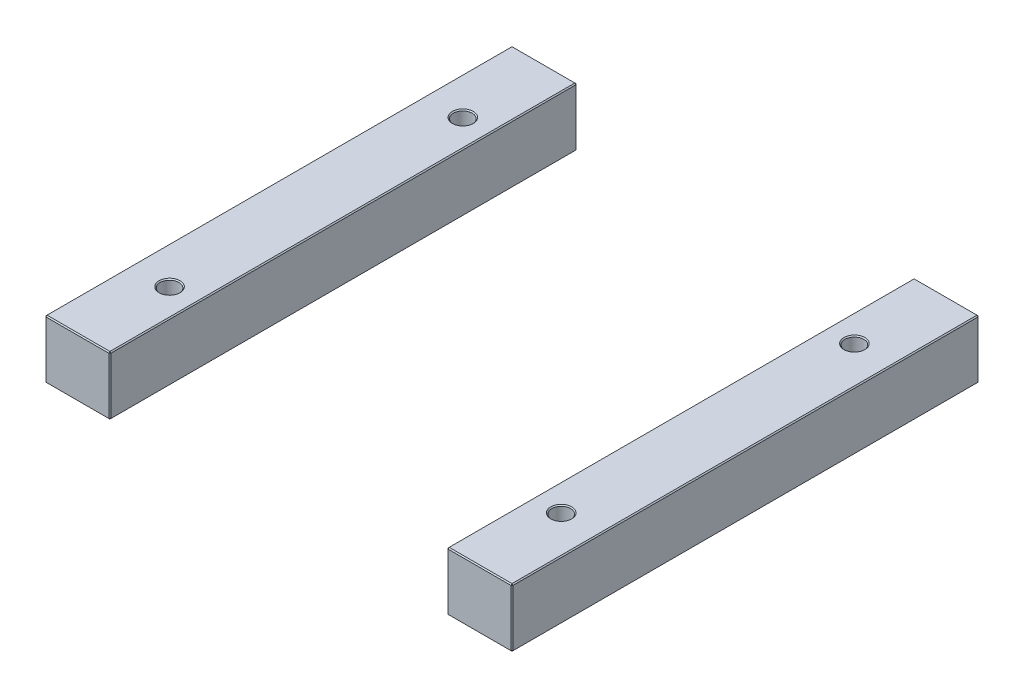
ISO-10303-21;
HEADER;
FILE_DESCRIPTION(('STEP AP214'),'2;1');
FILE_NAME('part.step','',(''),(''),'','','');
FILE_SCHEMA(('AUTOMOTIVE_DESIGN { 1 0 10303 214 1 1 1 1 }'));
ENDSEC;
DATA;
#1=APPLICATION_CONTEXT('core data for automotive mechanical design processes');
#2=APPLICATION_PROTOCOL_DEFINITION('international standard','automotive_design',2000,#1);
#3=PRODUCT_CONTEXT('',#1,'mechanical');
#4=PRODUCT('Part','Part','',(#3));
#5=PRODUCT_RELATED_PRODUCT_CATEGORY('part','',(#4));
#6=PRODUCT_DEFINITION_FORMATION('','',#4);
#7=PRODUCT_DEFINITION_CONTEXT('part definition',#1,'design');
#8=PRODUCT_DEFINITION('design','',#6,#7);
#9=PRODUCT_DEFINITION_SHAPE('','',#8);
#10=(LENGTH_UNIT() NAMED_UNIT(*) SI_UNIT(.MILLI.,.METRE.));
#11=(NAMED_UNIT(*) PLANE_ANGLE_UNIT() SI_UNIT($,.RADIAN.));
#12=(NAMED_UNIT(*) SI_UNIT($,.STERADIAN.) SOLID_ANGLE_UNIT());
#13=UNCERTAINTY_MEASURE_WITH_UNIT(LENGTH_MEASURE(1.E-05),#10,'distance_accuracy_value','');
#14=(GEOMETRIC_REPRESENTATION_CONTEXT(3) GLOBAL_UNCERTAINTY_ASSIGNED_CONTEXT((#13)) GLOBAL_UNIT_ASSIGNED_CONTEXT((#10,
#11,#12)) REPRESENTATION_CONTEXT('',''));
#15=CARTESIAN_POINT('',(0.,0.,0.));
#16=DIRECTION('',(0.,0.,1.));
#17=DIRECTION('',(1.,0.,0.));
#18=AXIS2_PLACEMENT_3D('',#15,#16,#17);
#19=CARTESIAN_POINT('',(-223.,56.,-223.));
#20=DIRECTION('',(0.,0.,1.));
#21=DIRECTION('',(1.,0.,0.));
#22=AXIS2_PLACEMENT_3D('',#19,#20,#21);
#23=PLANE('',#22);
#24=DIRECTION('',(-1.,0.,0.));
#25=VECTOR('',#24,1.);
#26=CARTESIAN_POINT('',(-223.,1.,-223.));
#27=LINE('',#26,#25);
#28=CARTESIAN_POINT('',(-162.,1.,-223.));
#29=VERTEX_POINT('',#28);
#30=CARTESIAN_POINT('',(-222.,1.,-223.));
#31=VERTEX_POINT('',#30);
#32=EDGE_CURVE('P0_E137',#29,#31,#27,.T.);
#33=ORIENTED_EDGE('',*,*,#32,.T.);
#34=DIRECTION('',(0.,1.,0.));
#35=VECTOR('',#34,1.);
#36=CARTESIAN_POINT('',(-222.,56.,-223.));
#37=LINE('',#36,#35);
#38=CARTESIAN_POINT('',(-222.,55.,-223.));
#39=VERTEX_POINT('',#38);
#40=EDGE_CURVE('P0_E235',#31,#39,#37,.T.);
#41=ORIENTED_EDGE('',*,*,#40,.T.);
#42=DIRECTION('',(1.,0.,0.));
#43=VECTOR('',#42,1.);
#44=CARTESIAN_POINT('',(-223.,55.,-223.));
#45=LINE('',#44,#43);
#46=CARTESIAN_POINT('',(-162.,55.,-223.));
#47=VERTEX_POINT('',#46);
#48=EDGE_CURVE('P0_E233',#39,#47,#45,.T.);
#49=ORIENTED_EDGE('',*,*,#48,.T.);
#50=DIRECTION('',(0.,-1.,0.));
#51=VECTOR('',#50,1.);
#52=CARTESIAN_POINT('',(-162.,56.,-223.));
#53=LINE('',#52,#51);
#54=EDGE_CURVE('P0_E230',#47,#29,#53,.T.);
#55=ORIENTED_EDGE('',*,*,#54,.T.);
#56=EDGE_LOOP('',(#33,#41,#49,#55));
#57=FACE_BOUND('',#56,.T.);
#58=ADVANCED_FACE('P0_F16',(#57),#23,.F.);
#59=CARTESIAN_POINT('',(-223.,56.,223.));
#60=DIRECTION('',(1.,0.,0.));
#61=DIRECTION('',(0.,0.,-1.));
#62=AXIS2_PLACEMENT_3D('',#59,#60,#61);
#63=PLANE('',#62);
#64=DIRECTION('',(0.,1.,0.));
#65=VECTOR('',#64,1.);
#66=CARTESIAN_POINT('',(-223.,56.,222.));
#67=LINE('',#66,#65);
#68=CARTESIAN_POINT('',(-223.,1.,222.));
#69=VERTEX_POINT('',#68);
#70=CARTESIAN_POINT('',(-223.,55.,222.));
#71=VERTEX_POINT('',#70);
#72=EDGE_CURVE('P0_E217',#69,#71,#67,.T.);
#73=ORIENTED_EDGE('',*,*,#72,.T.);
#74=DIRECTION('',(0.,0.,-1.));
#75=VECTOR('',#74,1.);
#76=CARTESIAN_POINT('',(-223.,55.,223.));
#77=LINE('',#76,#75);
#78=CARTESIAN_POINT('',(-223.,55.,-222.));
#79=VERTEX_POINT('',#78);
#80=EDGE_CURVE('P0_E228',#71,#79,#77,.T.);
#81=ORIENTED_EDGE('',*,*,#80,.T.);
#82=DIRECTION('',(0.,-1.,0.));
#83=VECTOR('',#82,1.);
#84=CARTESIAN_POINT('',(-223.,56.,-222.));
#85=LINE('',#84,#83);
#86=CARTESIAN_POINT('',(-223.,1.,-222.));
#87=VERTEX_POINT('',#86);
#88=EDGE_CURVE('P0_E225',#79,#87,#85,.T.);
#89=ORIENTED_EDGE('',*,*,#88,.T.);
#90=DIRECTION('',(0.,0.,1.));
#91=VECTOR('',#90,1.);
#92=CARTESIAN_POINT('',(-223.,1.,223.));
#93=LINE('',#92,#91);
#94=EDGE_CURVE('P0_E214',#87,#69,#93,.T.);
#95=ORIENTED_EDGE('',*,*,#94,.T.);
#96=EDGE_LOOP('',(#73,#81,#89,#95));
#97=FACE_BOUND('',#96,.T.);
#98=ADVANCED_FACE('P0_F302',(#97),#63,.F.);
#99=CARTESIAN_POINT('',(-223.,56.,223.));
#100=DIRECTION('',(0.,0.,-1.));
#101=DIRECTION('',(-1.,0.,0.));
#102=AXIS2_PLACEMENT_3D('',#99,#100,#101);
#103=PLANE('',#102);
#104=DIRECTION('',(-1.,0.,0.));
#105=VECTOR('',#104,1.);
#106=CARTESIAN_POINT('',(-223.,55.,223.));
#107=LINE('',#106,#105);
#108=CARTESIAN_POINT('',(-162.,55.,223.));
#109=VERTEX_POINT('',#108);
#110=CARTESIAN_POINT('',(-222.,55.,223.));
#111=VERTEX_POINT('',#110);
#112=EDGE_CURVE('P0_E242',#109,#111,#107,.T.);
#113=ORIENTED_EDGE('',*,*,#112,.T.);
#114=DIRECTION('',(0.,-1.,0.));
#115=VECTOR('',#114,1.);
#116=CARTESIAN_POINT('',(-222.,56.,223.));
#117=LINE('',#116,#115);
#118=CARTESIAN_POINT('',(-222.,1.,223.));
#119=VERTEX_POINT('',#118);
#120=EDGE_CURVE('P0_E244',#111,#119,#117,.T.);
#121=ORIENTED_EDGE('',*,*,#120,.T.);
#122=DIRECTION('',(1.,0.,0.));
#123=VECTOR('',#122,1.);
#124=CARTESIAN_POINT('',(-161.,1.,223.));
#125=LINE('',#124,#123);
#126=CARTESIAN_POINT('',(-162.,1.,223.));
#127=VERTEX_POINT('',#126);
#128=EDGE_CURVE('P0_E240',#119,#127,#125,.T.);
#129=ORIENTED_EDGE('',*,*,#128,.T.);
#130=DIRECTION('',(0.,1.,0.));
#131=VECTOR('',#130,1.);
#132=CARTESIAN_POINT('',(-162.,56.,223.));
#133=LINE('',#132,#131);
#134=EDGE_CURVE('P0_E238',#127,#109,#133,.T.);
#135=ORIENTED_EDGE('',*,*,#134,.T.);
#136=EDGE_LOOP('',(#113,#121,#129,#135));
#137=FACE_BOUND('',#136,.T.);
#138=ADVANCED_FACE('P0_F341',(#137),#103,.F.);
#139=CARTESIAN_POINT('',(-161.,56.,-223.));
#140=DIRECTION('',(-1.,0.,0.));
#141=DIRECTION('',(0.,0.,1.));
#142=AXIS2_PLACEMENT_3D('',#139,#140,#141);
#143=PLANE('',#142);
#144=DIRECTION('',(0.,0.,1.));
#145=VECTOR('',#144,1.);
#146=CARTESIAN_POINT('',(-161.,55.,-223.));
#147=LINE('',#146,#145);
#148=CARTESIAN_POINT('',(-161.,55.,-222.));
#149=VERTEX_POINT('',#148);
#150=CARTESIAN_POINT('',(-161.,55.,222.));
#151=VERTEX_POINT('',#150);
#152=EDGE_CURVE('P0_E31',#149,#151,#147,.T.);
#153=ORIENTED_EDGE('',*,*,#152,.T.);
#154=DIRECTION('',(0.,-1.,0.));
#155=VECTOR('',#154,1.);
#156=CARTESIAN_POINT('',(-161.,56.,222.));
#157=LINE('',#156,#155);
#158=CARTESIAN_POINT('',(-161.,1.,222.));
#159=VERTEX_POINT('',#158);
#160=EDGE_CURVE('P0_E190',#151,#159,#157,.T.);
#161=ORIENTED_EDGE('',*,*,#160,.T.);
#162=DIRECTION('',(0.,0.,-1.));
#163=VECTOR('',#162,1.);
#164=CARTESIAN_POINT('',(-161.,1.,-223.));
#165=LINE('',#164,#163);
#166=CARTESIAN_POINT('',(-161.,1.,-222.));
#167=VERTEX_POINT('',#166);
#168=EDGE_CURVE('P0_E256',#159,#167,#165,.T.);
#169=ORIENTED_EDGE('',*,*,#168,.T.);
#170=DIRECTION('',(0.,1.,0.));
#171=VECTOR('',#170,1.);
#172=CARTESIAN_POINT('',(-161.,56.,-222.));
#173=LINE('',#172,#171);
#174=EDGE_CURVE('P0_E36',#167,#149,#173,.T.);
#175=ORIENTED_EDGE('',*,*,#174,.T.);
#176=EDGE_LOOP('',(#153,#161,#169,#175));
#177=FACE_BOUND('',#176,.T.);
#178=ADVANCED_FACE('P0_F535',(#177),#143,.F.);
#179=CARTESIAN_POINT('',(0.,56.,0.));
#180=DIRECTION('',(0.,-1.,0.));
#181=DIRECTION('',(0.,0.,-1.));
#182=AXIS2_PLACEMENT_3D('',#179,#180,#181);
#183=PLANE('',#182);
#184=CARTESIAN_POINT('',(-187.,56.,140.));
#185=DIRECTION('',(0.,-1.,0.));
#186=DIRECTION('',(0.,0.,-1.));
#187=AXIS2_PLACEMENT_3D('',#184,#185,#186);
#188=CIRCLE('',#187,10.);
#189=CARTESIAN_POINT('',(-187.,56.,130.));
#190=VERTEX_POINT('',#189);
#191=EDGE_CURVE('P0_E24',#190,#190,#188,.T.);
#192=ORIENTED_EDGE('',*,*,#191,.T.);
#193=EDGE_LOOP('',(#192));
#194=FACE_BOUND('',#193,.T.);
#195=CARTESIAN_POINT('',(-187.,56.,-140.));
#196=DIRECTION('',(0.,-1.,0.));
#197=DIRECTION('',(0.,0.,-1.));
#198=AXIS2_PLACEMENT_3D('',#195,#196,#197);
#199=CIRCLE('',#198,10.);
#200=CARTESIAN_POINT('',(-187.,56.,-150.));
#201=VERTEX_POINT('',#200);
#202=EDGE_CURVE('P0_E189',#201,#201,#199,.T.);
#203=ORIENTED_EDGE('',*,*,#202,.T.);
#204=EDGE_LOOP('',(#203));
#205=FACE_BOUND('',#204,.T.);
#206=DIRECTION('',(0.,0.,1.));
#207=VECTOR('',#206,1.);
#208=CARTESIAN_POINT('',(-222.,56.,0.));
#209=LINE('',#208,#207);
#210=CARTESIAN_POINT('',(-222.,56.,-222.));
#211=VERTEX_POINT('',#210);
#212=CARTESIAN_POINT('',(-222.,56.,222.));
#213=VERTEX_POINT('',#212);
#214=EDGE_CURVE('P0_E251',#211,#213,#209,.T.);
#215=ORIENTED_EDGE('',*,*,#214,.T.);
#216=DIRECTION('',(1.,0.,0.));
#217=VECTOR('',#216,1.);
#218=CARTESIAN_POINT('',(0.,56.,222.));
#219=LINE('',#218,#217);
#220=CARTESIAN_POINT('',(-162.,56.,222.));
#221=VERTEX_POINT('',#220);
#222=EDGE_CURVE('P0_E253',#213,#221,#219,.T.);
#223=ORIENTED_EDGE('',*,*,#222,.T.);
#224=DIRECTION('',(0.,0.,-1.));
#225=VECTOR('',#224,1.);
#226=CARTESIAN_POINT('',(-162.,56.,0.));
#227=LINE('',#226,#225);
#228=CARTESIAN_POINT('',(-162.,56.,-222.));
#229=VERTEX_POINT('',#228);
#230=EDGE_CURVE('P0_E247',#221,#229,#227,.T.);
#231=ORIENTED_EDGE('',*,*,#230,.T.);
#232=DIRECTION('',(-1.,0.,0.));
#233=VECTOR('',#232,1.);
#234=CARTESIAN_POINT('',(0.,56.,-222.));
#235=LINE('',#234,#233);
#236=EDGE_CURVE('P0_E249',#229,#211,#235,.T.);
#237=ORIENTED_EDGE('',*,*,#236,.T.);
#238=EDGE_LOOP('',(#215,#223,#231,#237));
#239=FACE_BOUND('',#238,.T.);
#240=ADVANCED_FACE('P0_F195',(#194,#205,#239),#183,.F.);
#241=CARTESIAN_POINT('',(0.,0.,0.));
#242=DIRECTION('',(0.,-1.,0.));
#243=DIRECTION('',(0.,0.,-1.));
#244=AXIS2_PLACEMENT_3D('',#241,#242,#243);
#245=PLANE('',#244);
#246=CARTESIAN_POINT('',(-187.,0.,-140.));
#247=DIRECTION('',(0.,-1.,0.));
#248=DIRECTION('',(0.,0.,-1.));
#249=AXIS2_PLACEMENT_3D('',#246,#247,#248);
#250=CIRCLE('',#249,10.);
#251=CARTESIAN_POINT('',(-187.,0.,-150.));
#252=VERTEX_POINT('',#251);
#253=EDGE_CURVE('P0_E220',#252,#252,#250,.F.);
#254=ORIENTED_EDGE('',*,*,#253,.T.);
#255=EDGE_LOOP('',(#254));
#256=FACE_BOUND('',#255,.T.);
#257=CARTESIAN_POINT('',(-187.,0.,140.));
#258=DIRECTION('',(0.,-1.,0.));
#259=DIRECTION('',(0.,0.,-1.));
#260=AXIS2_PLACEMENT_3D('',#257,#258,#259);
#261=CIRCLE('',#260,10.);
#262=CARTESIAN_POINT('',(-187.,0.,130.));
#263=VERTEX_POINT('',#262);
#264=EDGE_CURVE('P0_E608',#263,#263,#261,.F.);
#265=ORIENTED_EDGE('',*,*,#264,.T.);
#266=EDGE_LOOP('',(#265));
#267=FACE_BOUND('',#266,.T.);
#268=DIRECTION('',(-1.,0.,0.));
#269=VECTOR('',#268,1.);
#270=CARTESIAN_POINT('',(-223.,0.,222.));
#271=LINE('',#270,#269);
#272=CARTESIAN_POINT('',(-162.,0.,222.));
#273=VERTEX_POINT('',#272);
#274=CARTESIAN_POINT('',(-222.,0.,222.));
#275=VERTEX_POINT('',#274);
#276=EDGE_CURVE('P0_E114',#273,#275,#271,.T.);
#277=ORIENTED_EDGE('',*,*,#276,.T.);
#278=DIRECTION('',(0.,0.,-1.));
#279=VECTOR('',#278,1.);
#280=CARTESIAN_POINT('',(-222.,0.,-223.));
#281=LINE('',#280,#279);
#282=CARTESIAN_POINT('',(-222.,0.,-222.));
#283=VERTEX_POINT('',#282);
#284=EDGE_CURVE('P0_E110',#275,#283,#281,.T.);
#285=ORIENTED_EDGE('',*,*,#284,.T.);
#286=DIRECTION('',(1.,0.,0.));
#287=VECTOR('',#286,1.);
#288=CARTESIAN_POINT('',(-161.,0.,-222.));
#289=LINE('',#288,#287);
#290=CARTESIAN_POINT('',(-162.,0.,-222.));
#291=VERTEX_POINT('',#290);
#292=EDGE_CURVE('P0_E104',#283,#291,#289,.T.);
#293=ORIENTED_EDGE('',*,*,#292,.T.);
#294=DIRECTION('',(0.,0.,1.));
#295=VECTOR('',#294,1.);
#296=CARTESIAN_POINT('',(-162.,0.,223.));
#297=LINE('',#296,#295);
#298=EDGE_CURVE('P0_E107',#291,#273,#297,.T.);
#299=ORIENTED_EDGE('',*,*,#298,.T.);
#300=EDGE_LOOP('',(#277,#285,#293,#299));
#301=FACE_BOUND('',#300,.T.);
#302=ADVANCED_FACE('P0_F106',(#256,#267,#301),#245,.T.);
#303=CARTESIAN_POINT('',(-187.,0.,-140.));
#304=DIRECTION('',(0.,1.,0.));
#305=DIRECTION('',(0.,0.,1.));
#306=AXIS2_PLACEMENT_3D('',#303,#304,#305);
#307=CYLINDRICAL_SURFACE('',#306,9.);
#308=CARTESIAN_POINT('',(-187.,55.,-140.));
#309=DIRECTION('',(0.,-1.,0.));
#310=DIRECTION('',(0.,0.,-1.));
#311=AXIS2_PLACEMENT_3D('',#308,#309,#310);
#312=CIRCLE('',#311,9.);
#313=CARTESIAN_POINT('',(-187.,55.,-149.));
#314=VERTEX_POINT('',#313);
#315=EDGE_CURVE('P0_E10',#314,#314,#312,.F.);
#316=ORIENTED_EDGE('',*,*,#315,.T.);
#317=EDGE_LOOP('',(#316));
#318=FACE_BOUND('',#317,.T.);
#319=CARTESIAN_POINT('',(-187.,1.00000000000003,-140.));
#320=DIRECTION('',(0.,-1.,0.));
#321=DIRECTION('',(0.,0.,-1.));
#322=AXIS2_PLACEMENT_3D('',#319,#320,#321);
#323=CIRCLE('',#322,9.);
#324=CARTESIAN_POINT('',(-187.,1.00000000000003,-149.));
#325=VERTEX_POINT('',#324);
#326=EDGE_CURVE('P0_E215',#325,#325,#323,.T.);
#327=ORIENTED_EDGE('',*,*,#326,.T.);
#328=EDGE_LOOP('',(#327));
#329=FACE_BOUND('',#328,.T.);
#330=ADVANCED_FACE('P0_F208',(#318,#329),#307,.F.);
#331=CARTESIAN_POINT('',(-187.,0.,140.));
#332=DIRECTION('',(0.,1.,0.));
#333=DIRECTION('',(0.,0.,1.));
#334=AXIS2_PLACEMENT_3D('',#331,#332,#333);
#335=CYLINDRICAL_SURFACE('',#334,9.);
#336=CARTESIAN_POINT('',(-187.,55.,140.));
#337=DIRECTION('',(0.,-1.,0.));
#338=DIRECTION('',(0.,0.,-1.));
#339=AXIS2_PLACEMENT_3D('',#336,#337,#338);
#340=CIRCLE('',#339,9.);
#341=CARTESIAN_POINT('',(-187.,55.,131.));
#342=VERTEX_POINT('',#341);
#343=EDGE_CURVE('P0_E186',#342,#342,#340,.F.);
#344=ORIENTED_EDGE('',*,*,#343,.T.);
#345=EDGE_LOOP('',(#344));
#346=FACE_BOUND('',#345,.T.);
#347=CARTESIAN_POINT('',(-187.,1.00000000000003,140.));
#348=DIRECTION('',(0.,-1.,0.));
#349=DIRECTION('',(0.,0.,-1.));
#350=AXIS2_PLACEMENT_3D('',#347,#348,#349);
#351=CIRCLE('',#350,9.);
#352=CARTESIAN_POINT('',(-187.,1.00000000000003,131.));
#353=VERTEX_POINT('',#352);
#354=EDGE_CURVE('P0_E212',#353,#353,#351,.T.);
#355=ORIENTED_EDGE('',*,*,#354,.T.);
#356=EDGE_LOOP('',(#355));
#357=FACE_BOUND('',#356,.T.);
#358=ADVANCED_FACE('P0_F204',(#346,#357),#335,.F.);
#359=CARTESIAN_POINT('',(-187.,0.,-140.));
#360=DIRECTION('',(0.,-1.,0.));
#361=DIRECTION('',(0.,0.,-1.));
#362=AXIS2_PLACEMENT_3D('',#359,#360,#361);
#363=CONICAL_SURFACE('',#362,10.,0.785398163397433);
#364=ORIENTED_EDGE('',*,*,#326,.F.);
#365=EDGE_LOOP('',(#364));
#366=FACE_BOUND('',#365,.T.);
#367=ORIENTED_EDGE('',*,*,#253,.F.);
#368=EDGE_LOOP('',(#367));
#369=FACE_BOUND('',#368,.T.);
#370=ADVANCED_FACE('P0_F207',(#366,#369),#363,.F.);
#371=CARTESIAN_POINT('',(-187.,0.,140.));
#372=DIRECTION('',(0.,-1.,0.));
#373=DIRECTION('',(0.,0.,-1.));
#374=AXIS2_PLACEMENT_3D('',#371,#372,#373);
#375=CONICAL_SURFACE('',#374,10.,0.785398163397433);
#376=ORIENTED_EDGE('',*,*,#354,.F.);
#377=EDGE_LOOP('',(#376));
#378=FACE_BOUND('',#377,.T.);
#379=ORIENTED_EDGE('',*,*,#264,.F.);
#380=EDGE_LOOP('',(#379));
#381=FACE_BOUND('',#380,.T.);
#382=ADVANCED_FACE('P0_F347',(#378,#381),#375,.F.);
#383=CARTESIAN_POINT('',(-161.,56.,222.));
#384=DIRECTION('',(-0.707106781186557,0.,-0.707106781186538));
#385=DIRECTION('',(0.,-1.,0.));
#386=AXIS2_PLACEMENT_3D('',#383,#384,#385);
#387=PLANE('',#386);
#388=DIRECTION('',(-0.707106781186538,0.,0.707106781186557));
#389=VECTOR('',#388,1.);
#390=CARTESIAN_POINT('',(-161.5,55.,222.5));
#391=LINE('',#390,#389);
#392=EDGE_CURVE('P0_E125',#109,#151,#391,.F.);
#393=ORIENTED_EDGE('',*,*,#392,.F.);
#394=ORIENTED_EDGE('',*,*,#134,.F.);
#395=DIRECTION('',(0.707106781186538,0.,-0.707106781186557));
#396=VECTOR('',#395,1.);
#397=CARTESIAN_POINT('',(-162.,1.,223.));
#398=LINE('',#397,#396);
#399=EDGE_CURVE('P0_E181',#159,#127,#398,.F.);
#400=ORIENTED_EDGE('',*,*,#399,.F.);
#401=ORIENTED_EDGE('',*,*,#160,.F.);
#402=EDGE_LOOP('',(#393,#394,#400,#401));
#403=FACE_BOUND('',#402,.T.);
#404=ADVANCED_FACE('P0_F351',(#403),#387,.F.);
#405=CARTESIAN_POINT('',(-162.,56.,222.));
#406=DIRECTION('',(0.577350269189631,0.577350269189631,0.577350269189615));
#407=DIRECTION('',(-0.707106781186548,0.707106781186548,0.));
#408=AXIS2_PLACEMENT_3D('',#405,#406,#407);
#409=PLANE('',#408);
#410=DIRECTION('',(0.,0.707106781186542,-0.707106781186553));
#411=VECTOR('',#410,1.);
#412=CARTESIAN_POINT('',(-162.,56.,222.));
#413=LINE('',#412,#411);
#414=EDGE_CURVE('P0_E175',#109,#221,#413,.T.);
#415=ORIENTED_EDGE('',*,*,#414,.F.);
#416=ORIENTED_EDGE('',*,*,#392,.T.);
#417=DIRECTION('',(0.707106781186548,-0.707106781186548,0.));
#418=VECTOR('',#417,1.);
#419=CARTESIAN_POINT('',(-162.,56.,222.));
#420=LINE('',#419,#418);
#421=EDGE_CURVE('P0_E178',#221,#151,#420,.T.);
#422=ORIENTED_EDGE('',*,*,#421,.F.);
#423=EDGE_LOOP('',(#415,#416,#422));
#424=FACE_BOUND('',#423,.T.);
#425=ADVANCED_FACE('P0_F487',(#424),#409,.T.);
#426=CARTESIAN_POINT('',(-162.,1.,223.));
#427=DIRECTION('',(0.577350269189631,-0.577350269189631,0.577350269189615));
#428=DIRECTION('',(0.707106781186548,0.707106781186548,0.));
#429=AXIS2_PLACEMENT_3D('',#426,#427,#428);
#430=PLANE('',#429);
#431=DIRECTION('',(0.707106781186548,0.707106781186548,0.));
#432=VECTOR('',#431,1.);
#433=CARTESIAN_POINT('',(-161.5,0.5,222.));
#434=LINE('',#433,#432);
#435=EDGE_CURVE('P0_E123',#159,#273,#434,.F.);
#436=ORIENTED_EDGE('',*,*,#435,.F.);
#437=ORIENTED_EDGE('',*,*,#399,.T.);
#438=DIRECTION('',(0.,-0.707106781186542,-0.707106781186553));
#439=VECTOR('',#438,1.);
#440=CARTESIAN_POINT('',(-162.,1.,223.));
#441=LINE('',#440,#439);
#442=EDGE_CURVE('P0_E172',#273,#127,#441,.F.);
#443=ORIENTED_EDGE('',*,*,#442,.F.);
#444=EDGE_LOOP('',(#436,#437,#443));
#445=FACE_BOUND('',#444,.T.);
#446=ADVANCED_FACE('P0_F478',(#445),#430,.T.);
#447=CARTESIAN_POINT('',(-162.,56.,0.));
#448=DIRECTION('',(-0.707106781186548,-0.707106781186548,0.));
#449=DIRECTION('',(0.,0.,-1.));
#450=AXIS2_PLACEMENT_3D('',#447,#448,#449);
#451=PLANE('',#450);
#452=ORIENTED_EDGE('',*,*,#421,.T.);
#453=ORIENTED_EDGE('',*,*,#152,.F.);
#454=DIRECTION('',(-0.707106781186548,0.707106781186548,0.));
#455=VECTOR('',#454,1.);
#456=CARTESIAN_POINT('',(-161.5,55.5,-222.));
#457=LINE('',#456,#455);
#458=EDGE_CURVE('P0_E165',#229,#149,#457,.F.);
#459=ORIENTED_EDGE('',*,*,#458,.F.);
#460=ORIENTED_EDGE('',*,*,#230,.F.);
#461=EDGE_LOOP('',(#452,#453,#459,#460));
#462=FACE_BOUND('',#461,.T.);
#463=ADVANCED_FACE('P0_F318',(#462),#451,.F.);
#464=CARTESIAN_POINT('',(0.,56.,222.));
#465=DIRECTION('',(0.,-0.707106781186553,-0.707106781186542));
#466=DIRECTION('',(1.,0.,0.));
#467=AXIS2_PLACEMENT_3D('',#464,#465,#466);
#468=PLANE('',#467);
#469=ORIENTED_EDGE('',*,*,#414,.T.);
#470=ORIENTED_EDGE('',*,*,#222,.F.);
#471=DIRECTION('',(0.,-0.707106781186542,0.707106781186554));
#472=VECTOR('',#471,1.);
#473=CARTESIAN_POINT('',(-222.,55.5,222.5));
#474=LINE('',#473,#472);
#475=EDGE_CURVE('P0_E162',#111,#213,#474,.F.);
#476=ORIENTED_EDGE('',*,*,#475,.F.);
#477=ORIENTED_EDGE('',*,*,#112,.F.);
#478=EDGE_LOOP('',(#469,#470,#476,#477));
#479=FACE_BOUND('',#478,.T.);
#480=ADVANCED_FACE('P0_F313',(#479),#468,.F.);
#481=CARTESIAN_POINT('',(-222.,56.,223.));
#482=DIRECTION('',(0.707106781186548,0.,-0.707106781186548));
#483=DIRECTION('',(0.,-1.,0.));
#484=AXIS2_PLACEMENT_3D('',#481,#482,#483);
#485=PLANE('',#484);
#486=DIRECTION('',(0.707106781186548,0.,0.707106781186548));
#487=VECTOR('',#486,1.);
#488=CARTESIAN_POINT('',(-222.,1.,223.));
#489=LINE('',#488,#487);
#490=EDGE_CURVE('P0_E156',#119,#69,#489,.F.);
#491=ORIENTED_EDGE('',*,*,#490,.F.);
#492=ORIENTED_EDGE('',*,*,#120,.F.);
#493=DIRECTION('',(-0.707106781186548,0.,-0.707106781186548));
#494=VECTOR('',#493,1.);
#495=CARTESIAN_POINT('',(-223.,55.,222.));
#496=LINE('',#495,#494);
#497=EDGE_CURVE('P0_E159',#71,#111,#496,.F.);
#498=ORIENTED_EDGE('',*,*,#497,.F.);
#499=ORIENTED_EDGE('',*,*,#72,.F.);
#500=EDGE_LOOP('',(#491,#492,#498,#499));
#501=FACE_BOUND('',#500,.T.);
#502=ADVANCED_FACE('P0_F307',(#501),#485,.F.);
#503=CARTESIAN_POINT('',(-223.,1.,223.));
#504=DIRECTION('',(0.,-0.707106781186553,0.707106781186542));
#505=DIRECTION('',(-1.,0.,0.));
#506=AXIS2_PLACEMENT_3D('',#503,#504,#505);
#507=PLANE('',#506);
#508=ORIENTED_EDGE('',*,*,#442,.T.);
#509=ORIENTED_EDGE('',*,*,#128,.F.);
#510=DIRECTION('',(0.,0.707106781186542,0.707106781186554));
#511=VECTOR('',#510,1.);
#512=CARTESIAN_POINT('',(-222.,1.,223.));
#513=LINE('',#512,#511);
#514=EDGE_CURVE('P0_E134',#275,#119,#513,.T.);
#515=ORIENTED_EDGE('',*,*,#514,.F.);
#516=ORIENTED_EDGE('',*,*,#276,.F.);
#517=EDGE_LOOP('',(#508,#509,#515,#516));
#518=FACE_BOUND('',#517,.T.);
#519=ADVANCED_FACE('P0_F333',(#518),#507,.T.);
#520=CARTESIAN_POINT('',(-161.,1.,-223.));
#521=DIRECTION('',(0.707106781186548,-0.707106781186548,0.));
#522=DIRECTION('',(0.,0.,1.));
#523=AXIS2_PLACEMENT_3D('',#520,#521,#522);
#524=PLANE('',#523);
#525=ORIENTED_EDGE('',*,*,#435,.T.);
#526=ORIENTED_EDGE('',*,*,#298,.F.);
#527=DIRECTION('',(-0.707106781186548,-0.707106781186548,0.));
#528=VECTOR('',#527,1.);
#529=CARTESIAN_POINT('',(-162.,0.,-222.));
#530=LINE('',#529,#528);
#531=EDGE_CURVE('P0_E120',#167,#291,#530,.T.);
#532=ORIENTED_EDGE('',*,*,#531,.F.);
#533=ORIENTED_EDGE('',*,*,#168,.F.);
#534=EDGE_LOOP('',(#525,#526,#532,#533));
#535=FACE_BOUND('',#534,.T.);
#536=ADVANCED_FACE('P0_F119',(#535),#524,.T.);
#537=CARTESIAN_POINT('',(-162.,56.,-223.));
#538=DIRECTION('',(-0.707106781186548,0.,0.707106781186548));
#539=DIRECTION('',(0.,-1.,0.));
#540=AXIS2_PLACEMENT_3D('',#537,#538,#539);
#541=PLANE('',#540);
#542=DIRECTION('',(0.707106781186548,0.,0.707106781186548));
#543=VECTOR('',#542,1.);
#544=CARTESIAN_POINT('',(-162.,55.,-223.));
#545=LINE('',#544,#543);
#546=EDGE_CURVE('P0_E168',#149,#47,#545,.F.);
#547=ORIENTED_EDGE('',*,*,#546,.F.);
#548=ORIENTED_EDGE('',*,*,#174,.F.);
#549=DIRECTION('',(-0.707106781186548,0.,-0.707106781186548));
#550=VECTOR('',#549,1.);
#551=CARTESIAN_POINT('',(-161.5,1.,-222.5));
#552=LINE('',#551,#550);
#553=EDGE_CURVE('P0_E133',#29,#167,#552,.F.);
#554=ORIENTED_EDGE('',*,*,#553,.F.);
#555=ORIENTED_EDGE('',*,*,#54,.F.);
#556=EDGE_LOOP('',(#547,#548,#554,#555));
#557=FACE_BOUND('',#556,.T.);
#558=ADVANCED_FACE('P0_F323',(#557),#541,.F.);
#559=CARTESIAN_POINT('',(-162.,55.,-223.));
#560=DIRECTION('',(0.577350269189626,0.577350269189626,-0.577350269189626));
#561=DIRECTION('',(-0.707106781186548,0.,-0.707106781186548));
#562=AXIS2_PLACEMENT_3D('',#559,#560,#561);
#563=PLANE('',#562);
#564=ORIENTED_EDGE('',*,*,#458,.T.);
#565=ORIENTED_EDGE('',*,*,#546,.T.);
#566=DIRECTION('',(0.,-0.707106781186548,-0.707106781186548));
#567=VECTOR('',#566,1.);
#568=CARTESIAN_POINT('',(-162.,55.,-223.));
#569=LINE('',#568,#567);
#570=EDGE_CURVE('P0_E151',#229,#47,#569,.T.);
#571=ORIENTED_EDGE('',*,*,#570,.F.);
#572=EDGE_LOOP('',(#564,#565,#571));
#573=FACE_BOUND('',#572,.T.);
#574=ADVANCED_FACE('P0_F321',(#573),#563,.T.);
#575=CARTESIAN_POINT('',(-223.,55.,222.));
#576=DIRECTION('',(-0.57735026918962,0.577350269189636,0.57735026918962));
#577=DIRECTION('',(0.,-0.707106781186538,0.707106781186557));
#578=AXIS2_PLACEMENT_3D('',#575,#576,#577);
#579=PLANE('',#578);
#580=ORIENTED_EDGE('',*,*,#497,.T.);
#581=ORIENTED_EDGE('',*,*,#475,.T.);
#582=DIRECTION('',(0.707106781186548,0.707106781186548,0.));
#583=VECTOR('',#582,1.);
#584=CARTESIAN_POINT('',(-223.,55.,222.));
#585=LINE('',#584,#583);
#586=EDGE_CURVE('P0_E142',#71,#213,#585,.T.);
#587=ORIENTED_EDGE('',*,*,#586,.F.);
#588=EDGE_LOOP('',(#580,#581,#587));
#589=FACE_BOUND('',#588,.T.);
#590=ADVANCED_FACE('P0_F310',(#589),#579,.T.);
#591=CARTESIAN_POINT('',(-222.,1.,223.));
#592=DIRECTION('',(-0.57735026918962,-0.577350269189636,0.57735026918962));
#593=DIRECTION('',(0.,-0.707106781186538,-0.707106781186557));
#594=AXIS2_PLACEMENT_3D('',#591,#592,#593);
#595=PLANE('',#594);
#596=ORIENTED_EDGE('',*,*,#514,.T.);
#597=ORIENTED_EDGE('',*,*,#490,.T.);
#598=DIRECTION('',(0.707106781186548,-0.707106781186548,0.));
#599=VECTOR('',#598,1.);
#600=CARTESIAN_POINT('',(-222.5,0.500000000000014,222.));
#601=LINE('',#600,#599);
#602=EDGE_CURVE('P0_E138',#275,#69,#601,.F.);
#603=ORIENTED_EDGE('',*,*,#602,.F.);
#604=EDGE_LOOP('',(#596,#597,#603));
#605=FACE_BOUND('',#604,.T.);
#606=ADVANCED_FACE('P0_F368',(#605),#595,.T.);
#607=CARTESIAN_POINT('',(-162.,0.,-222.));
#608=DIRECTION('',(0.577350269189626,-0.577350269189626,-0.577350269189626));
#609=DIRECTION('',(-0.707106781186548,0.,-0.707106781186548));
#610=AXIS2_PLACEMENT_3D('',#607,#608,#609);
#611=PLANE('',#610);
#612=ORIENTED_EDGE('',*,*,#553,.T.);
#613=ORIENTED_EDGE('',*,*,#531,.T.);
#614=DIRECTION('',(0.,0.707106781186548,-0.707106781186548));
#615=VECTOR('',#614,1.);
#616=CARTESIAN_POINT('',(-162.,0.,-222.));
#617=LINE('',#616,#615);
#618=EDGE_CURVE('P0_E130',#29,#291,#617,.F.);
#619=ORIENTED_EDGE('',*,*,#618,.F.);
#620=EDGE_LOOP('',(#612,#613,#619));
#621=FACE_BOUND('',#620,.T.);
#622=ADVANCED_FACE('P0_F129',(#621),#611,.T.);
#623=CARTESIAN_POINT('',(0.,56.,-222.));
#624=DIRECTION('',(0.,-0.707106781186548,0.707106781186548));
#625=DIRECTION('',(-1.,0.,0.));
#626=AXIS2_PLACEMENT_3D('',#623,#624,#625);
#627=PLANE('',#626);
#628=ORIENTED_EDGE('',*,*,#570,.T.);
#629=ORIENTED_EDGE('',*,*,#48,.F.);
#630=DIRECTION('',(0.,0.707106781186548,0.707106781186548));
#631=VECTOR('',#630,1.);
#632=CARTESIAN_POINT('',(-222.,55.,-223.));
#633=LINE('',#632,#631);
#634=EDGE_CURVE('P0_E139',#211,#39,#633,.F.);
#635=ORIENTED_EDGE('',*,*,#634,.F.);
#636=ORIENTED_EDGE('',*,*,#236,.F.);
#637=EDGE_LOOP('',(#628,#629,#635,#636));
#638=FACE_BOUND('',#637,.T.);
#639=ADVANCED_FACE('P0_F286',(#638),#627,.F.);
#640=CARTESIAN_POINT('',(-222.,56.,0.));
#641=DIRECTION('',(0.707106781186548,-0.707106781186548,0.));
#642=DIRECTION('',(0.,0.,1.));
#643=AXIS2_PLACEMENT_3D('',#640,#641,#642);
#644=PLANE('',#643);
#645=ORIENTED_EDGE('',*,*,#586,.T.);
#646=ORIENTED_EDGE('',*,*,#214,.F.);
#647=DIRECTION('',(-0.707106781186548,-0.707106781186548,0.));
#648=VECTOR('',#647,1.);
#649=CARTESIAN_POINT('',(-222.5,55.5,-222.));
#650=LINE('',#649,#648);
#651=EDGE_CURVE('P0_E145',#79,#211,#650,.F.);
#652=ORIENTED_EDGE('',*,*,#651,.F.);
#653=ORIENTED_EDGE('',*,*,#80,.F.);
#654=EDGE_LOOP('',(#645,#646,#652,#653));
#655=FACE_BOUND('',#654,.T.);
#656=ADVANCED_FACE('P0_F280',(#655),#644,.F.);
#657=CARTESIAN_POINT('',(-223.,1.,223.));
#658=DIRECTION('',(-0.707106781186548,-0.707106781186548,0.));
#659=DIRECTION('',(0.,0.,-1.));
#660=AXIS2_PLACEMENT_3D('',#657,#658,#659);
#661=PLANE('',#660);
#662=ORIENTED_EDGE('',*,*,#602,.T.);
#663=ORIENTED_EDGE('',*,*,#94,.F.);
#664=DIRECTION('',(-0.707106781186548,0.707106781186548,0.));
#665=VECTOR('',#664,1.);
#666=CARTESIAN_POINT('',(-223.,1.,-222.));
#667=LINE('',#666,#665);
#668=EDGE_CURVE('P0_E267',#283,#87,#667,.T.);
#669=ORIENTED_EDGE('',*,*,#668,.F.);
#670=ORIENTED_EDGE('',*,*,#284,.F.);
#671=EDGE_LOOP('',(#662,#663,#669,#670));
#672=FACE_BOUND('',#671,.T.);
#673=ADVANCED_FACE('P0_F298',(#672),#661,.T.);
#674=CARTESIAN_POINT('',(-223.,1.,-223.));
#675=DIRECTION('',(0.,-0.707106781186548,-0.707106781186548));
#676=DIRECTION('',(1.,0.,0.));
#677=AXIS2_PLACEMENT_3D('',#674,#675,#676);
#678=PLANE('',#677);
#679=ORIENTED_EDGE('',*,*,#618,.T.);
#680=ORIENTED_EDGE('',*,*,#292,.F.);
#681=DIRECTION('',(0.,-0.707106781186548,0.707106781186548));
#682=VECTOR('',#681,1.);
#683=CARTESIAN_POINT('',(-222.,0.5,-222.5));
#684=LINE('',#683,#682);
#685=EDGE_CURVE('P0_E265',#31,#283,#684,.T.);
#686=ORIENTED_EDGE('',*,*,#685,.F.);
#687=ORIENTED_EDGE('',*,*,#32,.F.);
#688=EDGE_LOOP('',(#679,#680,#686,#687));
#689=FACE_BOUND('',#688,.T.);
#690=ADVANCED_FACE('P0_F136',(#689),#678,.T.);
#691=CARTESIAN_POINT('',(-222.,55.,-223.));
#692=DIRECTION('',(-0.577350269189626,0.577350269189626,-0.577350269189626));
#693=DIRECTION('',(-0.707106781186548,0.,0.707106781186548));
#694=AXIS2_PLACEMENT_3D('',#691,#692,#693);
#695=PLANE('',#694);
#696=ORIENTED_EDGE('',*,*,#651,.T.);
#697=ORIENTED_EDGE('',*,*,#634,.T.);
#698=DIRECTION('',(0.707106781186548,0.,-0.707106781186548));
#699=VECTOR('',#698,1.);
#700=CARTESIAN_POINT('',(-222.,55.,-223.));
#701=LINE('',#700,#699);
#702=EDGE_CURVE('P0_E263',#79,#39,#701,.T.);
#703=ORIENTED_EDGE('',*,*,#702,.F.);
#704=EDGE_LOOP('',(#696,#697,#703));
#705=FACE_BOUND('',#704,.T.);
#706=ADVANCED_FACE('P0_F273',(#705),#695,.T.);
#707=CARTESIAN_POINT('',(-223.,1.,-222.));
#708=DIRECTION('',(-0.577350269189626,-0.577350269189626,-0.577350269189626));
#709=DIRECTION('',(-0.707106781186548,0.,0.707106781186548));
#710=AXIS2_PLACEMENT_3D('',#707,#708,#709);
#711=PLANE('',#710);
#712=ORIENTED_EDGE('',*,*,#685,.T.);
#713=ORIENTED_EDGE('',*,*,#668,.T.);
#714=DIRECTION('',(-0.707106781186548,0.,0.707106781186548));
#715=VECTOR('',#714,1.);
#716=CARTESIAN_POINT('',(-223.,1.,-222.));
#717=LINE('',#716,#715);
#718=EDGE_CURVE('P0_E261',#31,#87,#717,.T.);
#719=ORIENTED_EDGE('',*,*,#718,.F.);
#720=EDGE_LOOP('',(#712,#713,#719));
#721=FACE_BOUND('',#720,.T.);
#722=ADVANCED_FACE('P0_F294',(#721),#711,.T.);
#723=CARTESIAN_POINT('',(-223.,56.,-222.));
#724=DIRECTION('',(0.707106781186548,0.,0.707106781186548));
#725=DIRECTION('',(0.,-1.,0.));
#726=AXIS2_PLACEMENT_3D('',#723,#724,#725);
#727=PLANE('',#726);
#728=ORIENTED_EDGE('',*,*,#702,.T.);
#729=ORIENTED_EDGE('',*,*,#40,.F.);
#730=ORIENTED_EDGE('',*,*,#718,.T.);
#731=ORIENTED_EDGE('',*,*,#88,.F.);
#732=EDGE_LOOP('',(#728,#729,#730,#731));
#733=FACE_BOUND('',#732,.T.);
#734=ADVANCED_FACE('P0_F201',(#733),#727,.F.);
#735=CARTESIAN_POINT('',(-187.,55.,140.));
#736=DIRECTION('',(0.,1.,0.));
#737=DIRECTION('',(0.,0.,1.));
#738=AXIS2_PLACEMENT_3D('',#735,#736,#737);
#739=CONICAL_SURFACE('',#738,9.,0.785398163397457);
#740=ORIENTED_EDGE('',*,*,#191,.F.);
#741=EDGE_LOOP('',(#740));
#742=FACE_BOUND('',#741,.T.);
#743=ORIENTED_EDGE('',*,*,#343,.F.);
#744=EDGE_LOOP('',(#743));
#745=FACE_BOUND('',#744,.T.);
#746=ADVANCED_FACE('P0_F198',(#742,#745),#739,.F.);
#747=CARTESIAN_POINT('',(-187.,55.,-140.));
#748=DIRECTION('',(0.,1.,0.));
#749=DIRECTION('',(0.,0.,1.));
#750=AXIS2_PLACEMENT_3D('',#747,#748,#749);
#751=CONICAL_SURFACE('',#750,9.,0.785398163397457);
#752=ORIENTED_EDGE('',*,*,#202,.F.);
#753=EDGE_LOOP('',(#752));
#754=FACE_BOUND('',#753,.T.);
#755=ORIENTED_EDGE('',*,*,#315,.F.);
#756=EDGE_LOOP('',(#755));
#757=FACE_BOUND('',#756,.T.);
#758=ADVANCED_FACE('P0_F18',(#754,#757),#751,.F.);
#759=CLOSED_SHELL('',(#58,#98,#138,#178,#240,#302,#330,#358,#370,#382,#404,#425,#446,#463,#480,
#502,#519,#536,#558,#574,#590,#606,#622,#639,#656,#673,#690,#706,#722,#734,#746,#758));
#760=MANIFOLD_SOLID_BREP('P0_B1',#759);
#761=CARTESIAN_POINT('',(223.,56.,223.));
#762=DIRECTION('',(0.,0.,-1.));
#763=DIRECTION('',(-1.,0.,0.));
#764=AXIS2_PLACEMENT_3D('',#761,#762,#763);
#765=PLANE('',#764);
#766=DIRECTION('',(0.,-1.,0.));
#767=VECTOR('',#766,1.);
#768=CARTESIAN_POINT('',(162.,56.,223.));
#769=LINE('',#768,#767);
#770=CARTESIAN_POINT('',(162.,55.,223.));
#771=VERTEX_POINT('',#770);
#772=CARTESIAN_POINT('',(162.,1.,223.));
#773=VERTEX_POINT('',#772);
#774=EDGE_CURVE('P1_E173',#771,#773,#769,.T.);
#775=ORIENTED_EDGE('',*,*,#774,.T.);
#776=DIRECTION('',(1.,0.,0.));
#777=VECTOR('',#776,1.);
#778=CARTESIAN_POINT('',(223.,1.,223.));
#779=LINE('',#778,#777);
#780=CARTESIAN_POINT('',(222.,1.,223.));
#781=VERTEX_POINT('',#780);
#782=EDGE_CURVE('P1_E175',#773,#781,#779,.T.);
#783=ORIENTED_EDGE('',*,*,#782,.T.);
#784=DIRECTION('',(0.,1.,0.));
#785=VECTOR('',#784,1.);
#786=CARTESIAN_POINT('',(222.,56.,223.));
#787=LINE('',#786,#785);
#788=CARTESIAN_POINT('',(222.,55.,223.));
#789=VERTEX_POINT('',#788);
#790=EDGE_CURVE('P1_E171',#781,#789,#787,.T.);
#791=ORIENTED_EDGE('',*,*,#790,.T.);
#792=DIRECTION('',(-1.,0.,0.));
#793=VECTOR('',#792,1.);
#794=CARTESIAN_POINT('',(161.,55.,223.));
#795=LINE('',#794,#793);
#796=EDGE_CURVE('P1_E169',#789,#771,#795,.T.);
#797=ORIENTED_EDGE('',*,*,#796,.T.);
#798=EDGE_LOOP('',(#775,#783,#791,#797));
#799=FACE_BOUND('',#798,.T.);
#800=ADVANCED_FACE('P1_F16',(#799),#765,.F.);
#801=CARTESIAN_POINT('',(223.,56.,223.));
#802=DIRECTION('',(-1.,0.,0.));
#803=DIRECTION('',(0.,0.,1.));
#804=AXIS2_PLACEMENT_3D('',#801,#802,#803);
#805=PLANE('',#804);
#806=DIRECTION('',(0.,0.,1.));
#807=VECTOR('',#806,1.);
#808=CARTESIAN_POINT('',(223.,55.,223.));
#809=LINE('',#808,#807);
#810=CARTESIAN_POINT('',(223.,55.,-222.));
#811=VERTEX_POINT('',#810);
#812=CARTESIAN_POINT('',(223.,55.,222.));
#813=VERTEX_POINT('',#812);
#814=EDGE_CURVE('P1_E187',#811,#813,#809,.T.);
#815=ORIENTED_EDGE('',*,*,#814,.T.);
#816=DIRECTION('',(0.,-1.,0.));
#817=VECTOR('',#816,1.);
#818=CARTESIAN_POINT('',(223.,56.,222.));
#819=LINE('',#818,#817);
#820=CARTESIAN_POINT('',(223.,1.,222.));
#821=VERTEX_POINT('',#820);
#822=EDGE_CURVE('P1_E193',#813,#821,#819,.T.);
#823=ORIENTED_EDGE('',*,*,#822,.T.);
#824=DIRECTION('',(0.,0.,-1.));
#825=VECTOR('',#824,1.);
#826=CARTESIAN_POINT('',(223.,1.,223.));
#827=LINE('',#826,#825);
#828=CARTESIAN_POINT('',(223.,1.,-222.));
#829=VERTEX_POINT('',#828);
#830=EDGE_CURVE('P1_E191',#821,#829,#827,.T.);
#831=ORIENTED_EDGE('',*,*,#830,.T.);
#832=DIRECTION('',(0.,1.,0.));
#833=VECTOR('',#832,1.);
#834=CARTESIAN_POINT('',(223.,56.,-222.));
#835=LINE('',#834,#833);
#836=EDGE_CURVE('P1_E189',#829,#811,#835,.T.);
#837=ORIENTED_EDGE('',*,*,#836,.T.);
#838=EDGE_LOOP('',(#815,#823,#831,#837));
#839=FACE_BOUND('',#838,.T.);
#840=ADVANCED_FACE('P1_F275',(#839),#805,.F.);
#841=CARTESIAN_POINT('',(223.,56.,-223.));
#842=DIRECTION('',(0.,0.,1.));
#843=DIRECTION('',(1.,0.,0.));
#844=AXIS2_PLACEMENT_3D('',#841,#842,#843);
#845=PLANE('',#844);
#846=DIRECTION('',(0.,-1.,0.));
#847=VECTOR('',#846,1.);
#848=CARTESIAN_POINT('',(222.,56.,-223.));
#849=LINE('',#848,#847);
#850=CARTESIAN_POINT('',(222.,55.,-223.));
#851=VERTEX_POINT('',#850);
#852=CARTESIAN_POINT('',(222.,1.,-223.));
#853=VERTEX_POINT('',#852);
#854=EDGE_CURVE('P1_E164',#851,#853,#849,.T.);
#855=ORIENTED_EDGE('',*,*,#854,.T.);
#856=DIRECTION('',(-1.,0.,0.));
#857=VECTOR('',#856,1.);
#858=CARTESIAN_POINT('',(223.,1.,-223.));
#859=LINE('',#858,#857);
#860=CARTESIAN_POINT('',(162.,1.,-223.));
#861=VERTEX_POINT('',#860);
#862=EDGE_CURVE('P1_E112',#853,#861,#859,.T.);
#863=ORIENTED_EDGE('',*,*,#862,.T.);
#864=DIRECTION('',(0.,1.,0.));
#865=VECTOR('',#864,1.);
#866=CARTESIAN_POINT('',(162.,56.,-223.));
#867=LINE('',#866,#865);
#868=CARTESIAN_POINT('',(162.,55.,-223.));
#869=VERTEX_POINT('',#868);
#870=EDGE_CURVE('P1_E166',#861,#869,#867,.T.);
#871=ORIENTED_EDGE('',*,*,#870,.T.);
#872=DIRECTION('',(1.,0.,0.));
#873=VECTOR('',#872,1.);
#874=CARTESIAN_POINT('',(223.,55.,-223.));
#875=LINE('',#874,#873);
#876=EDGE_CURVE('P1_E162',#869,#851,#875,.T.);
#877=ORIENTED_EDGE('',*,*,#876,.T.);
#878=EDGE_LOOP('',(#855,#863,#871,#877));
#879=FACE_BOUND('',#878,.T.);
#880=ADVANCED_FACE('P1_F332',(#879),#845,.F.);
#881=CARTESIAN_POINT('',(161.,56.,-223.));
#882=DIRECTION('',(1.,0.,0.));
#883=DIRECTION('',(0.,0.,-1.));
#884=AXIS2_PLACEMENT_3D('',#881,#882,#883);
#885=PLANE('',#884);
#886=DIRECTION('',(0.,0.,-1.));
#887=VECTOR('',#886,1.);
#888=CARTESIAN_POINT('',(161.,55.,-223.));
#889=LINE('',#888,#887);
#890=CARTESIAN_POINT('',(161.,55.,222.));
#891=VERTEX_POINT('',#890);
#892=CARTESIAN_POINT('',(161.,55.,-222.));
#893=VERTEX_POINT('',#892);
#894=EDGE_CURVE('P1_E178',#891,#893,#889,.T.);
#895=ORIENTED_EDGE('',*,*,#894,.T.);
#896=DIRECTION('',(0.,-1.,0.));
#897=VECTOR('',#896,1.);
#898=CARTESIAN_POINT('',(161.,56.,-222.));
#899=LINE('',#898,#897);
#900=CARTESIAN_POINT('',(161.,1.,-222.));
#901=VERTEX_POINT('',#900);
#902=EDGE_CURVE('P1_E184',#893,#901,#899,.T.);
#903=ORIENTED_EDGE('',*,*,#902,.T.);
#904=DIRECTION('',(0.,0.,1.));
#905=VECTOR('',#904,1.);
#906=CARTESIAN_POINT('',(161.,1.,-223.));
#907=LINE('',#906,#905);
#908=CARTESIAN_POINT('',(161.,1.,222.));
#909=VERTEX_POINT('',#908);
#910=EDGE_CURVE('P1_E182',#901,#909,#907,.T.);
#911=ORIENTED_EDGE('',*,*,#910,.T.);
#912=DIRECTION('',(0.,1.,0.));
#913=VECTOR('',#912,1.);
#914=CARTESIAN_POINT('',(161.,56.,222.));
#915=LINE('',#914,#913);
#916=EDGE_CURVE('P1_E180',#909,#891,#915,.T.);
#917=ORIENTED_EDGE('',*,*,#916,.T.);
#918=EDGE_LOOP('',(#895,#903,#911,#917));
#919=FACE_BOUND('',#918,.T.);
#920=ADVANCED_FACE('P1_F543',(#919),#885,.F.);
#921=CARTESIAN_POINT('',(0.,56.,0.));
#922=DIRECTION('',(0.,1.,0.));
#923=DIRECTION('',(0.,0.,1.));
#924=AXIS2_PLACEMENT_3D('',#921,#922,#923);
#925=PLANE('',#924);
#926=DIRECTION('',(-1.,0.,0.));
#927=VECTOR('',#926,1.);
#928=CARTESIAN_POINT('',(161.,56.,-222.));
#929=LINE('',#928,#927);
#930=CARTESIAN_POINT('',(222.,56.,-222.));
#931=VERTEX_POINT('',#930);
#932=CARTESIAN_POINT('',(162.,56.,-222.));
#933=VERTEX_POINT('',#932);
#934=EDGE_CURVE('P1_E25',#931,#933,#929,.T.);
#935=ORIENTED_EDGE('',*,*,#934,.T.);
#936=DIRECTION('',(0.,0.,1.));
#937=VECTOR('',#936,1.);
#938=CARTESIAN_POINT('',(162.,56.,223.));
#939=LINE('',#938,#937);
#940=CARTESIAN_POINT('',(162.,56.,222.));
#941=VERTEX_POINT('',#940);
#942=EDGE_CURVE('P1_E10',#933,#941,#939,.T.);
#943=ORIENTED_EDGE('',*,*,#942,.T.);
#944=DIRECTION('',(1.,0.,0.));
#945=VECTOR('',#944,1.);
#946=CARTESIAN_POINT('',(223.,56.,222.));
#947=LINE('',#946,#945);
#948=CARTESIAN_POINT('',(222.,56.,222.));
#949=VERTEX_POINT('',#948);
#950=EDGE_CURVE('P1_E202',#941,#949,#947,.T.);
#951=ORIENTED_EDGE('',*,*,#950,.T.);
#952=DIRECTION('',(0.,0.,-1.));
#953=VECTOR('',#952,1.);
#954=CARTESIAN_POINT('',(222.,56.,-223.));
#955=LINE('',#954,#953);
#956=EDGE_CURVE('P1_E36',#949,#931,#955,.T.);
#957=ORIENTED_EDGE('',*,*,#956,.T.);
#958=EDGE_LOOP('',(#935,#943,#951,#957));
#959=FACE_BOUND('',#958,.T.);
#960=CARTESIAN_POINT('',(187.,56.,-140.));
#961=DIRECTION('',(0.,1.,0.));
#962=DIRECTION('',(0.,0.,1.));
#963=AXIS2_PLACEMENT_3D('',#960,#961,#962);
#964=CIRCLE('',#963,10.);
#965=CARTESIAN_POINT('',(187.,56.,-130.));
#966=VERTEX_POINT('',#965);
#967=EDGE_CURVE('P1_E199',#966,#966,#964,.F.);
#968=ORIENTED_EDGE('',*,*,#967,.T.);
#969=EDGE_LOOP('',(#968));
#970=FACE_BOUND('',#969,.T.);
#971=CARTESIAN_POINT('',(187.,56.,140.));
#972=DIRECTION('',(0.,1.,0.));
#973=DIRECTION('',(0.,0.,1.));
#974=AXIS2_PLACEMENT_3D('',#971,#972,#973);
#975=CIRCLE('',#974,10.);
#976=CARTESIAN_POINT('',(187.,56.,150.));
#977=VERTEX_POINT('',#976);
#978=EDGE_CURVE('P1_E196',#977,#977,#975,.F.);
#979=ORIENTED_EDGE('',*,*,#978,.T.);
#980=EDGE_LOOP('',(#979));
#981=FACE_BOUND('',#980,.T.);
#982=ADVANCED_FACE('P1_F298',(#959,#970,#981),#925,.T.);
#983=CARTESIAN_POINT('',(0.,0.,0.));
#984=DIRECTION('',(0.,1.,0.));
#985=DIRECTION('',(0.,0.,1.));
#986=AXIS2_PLACEMENT_3D('',#983,#984,#985);
#987=PLANE('',#986);
#988=CARTESIAN_POINT('',(187.,0.,-140.));
#989=DIRECTION('',(0.,1.,0.));
#990=DIRECTION('',(0.,0.,1.));
#991=AXIS2_PLACEMENT_3D('',#988,#989,#990);
#992=CIRCLE('',#991,10.);
#993=CARTESIAN_POINT('',(187.,0.,-130.));
#994=VERTEX_POINT('',#993);
#995=EDGE_CURVE('P1_E147',#994,#994,#992,.T.);
#996=ORIENTED_EDGE('',*,*,#995,.T.);
#997=EDGE_LOOP('',(#996));
#998=FACE_BOUND('',#997,.T.);
#999=CARTESIAN_POINT('',(187.,0.,140.));
#1000=DIRECTION('',(0.,1.,0.));
#1001=DIRECTION('',(0.,0.,1.));
#1002=AXIS2_PLACEMENT_3D('',#999,#1000,#1001);
#1003=CIRCLE('',#1002,10.);
#1004=CARTESIAN_POINT('',(187.,0.,150.));
#1005=VERTEX_POINT('',#1004);
#1006=EDGE_CURVE('P1_E141',#1005,#1005,#1003,.T.);
#1007=ORIENTED_EDGE('',*,*,#1006,.T.);
#1008=EDGE_LOOP('',(#1007));
#1009=FACE_BOUND('',#1008,.T.);
#1010=DIRECTION('',(-1.,0.,0.));
#1011=VECTOR('',#1010,1.);
#1012=CARTESIAN_POINT('',(1.98765735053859E-13,0.,222.));
#1013=LINE('',#1012,#1011);
#1014=CARTESIAN_POINT('',(222.,0.,222.));
#1015=VERTEX_POINT('',#1014);
#1016=CARTESIAN_POINT('',(162.,0.,222.));
#1017=VERTEX_POINT('',#1016);
#1018=EDGE_CURVE('P1_E134',#1015,#1017,#1013,.T.);
#1019=ORIENTED_EDGE('',*,*,#1018,.T.);
#1020=DIRECTION('',(0.,0.,-1.));
#1021=VECTOR('',#1020,1.);
#1022=CARTESIAN_POINT('',(162.,0.,0.));
#1023=LINE('',#1022,#1021);
#1024=CARTESIAN_POINT('',(162.,0.,-222.));
#1025=VERTEX_POINT('',#1024);
#1026=EDGE_CURVE('P1_E138',#1017,#1025,#1023,.T.);
#1027=ORIENTED_EDGE('',*,*,#1026,.T.);
#1028=DIRECTION('',(1.,0.,0.));
#1029=VECTOR('',#1028,1.);
#1030=CARTESIAN_POINT('',(-5.96297205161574E-13,0.,-222.));
#1031=LINE('',#1030,#1029);
#1032=CARTESIAN_POINT('',(222.,0.,-222.));
#1033=VERTEX_POINT('',#1032);
#1034=EDGE_CURVE('P1_E109',#1025,#1033,#1031,.T.);
#1035=ORIENTED_EDGE('',*,*,#1034,.T.);
#1036=DIRECTION('',(0.,0.,1.));
#1037=VECTOR('',#1036,1.);
#1038=CARTESIAN_POINT('',(222.,0.,0.));
#1039=LINE('',#1038,#1037);
#1040=EDGE_CURVE('P1_E128',#1033,#1015,#1039,.T.);
#1041=ORIENTED_EDGE('',*,*,#1040,.T.);
#1042=EDGE_LOOP('',(#1019,#1027,#1035,#1041));
#1043=FACE_BOUND('',#1042,.T.);
#1044=ADVANCED_FACE('P1_F136',(#998,#1009,#1043),#987,.F.);
#1045=CARTESIAN_POINT('',(187.,0.,-140.));
#1046=DIRECTION('',(0.,1.,0.));
#1047=DIRECTION('',(0.,0.,1.));
#1048=AXIS2_PLACEMENT_3D('',#1045,#1046,#1047);
#1049=CYLINDRICAL_SURFACE('',#1048,9.);
#1050=CARTESIAN_POINT('',(187.,0.999999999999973,-140.));
#1051=DIRECTION('',(0.,1.,0.));
#1052=DIRECTION('',(0.,0.,1.));
#1053=AXIS2_PLACEMENT_3D('',#1050,#1051,#1052);
#1054=CIRCLE('',#1053,9.);
#1055=CARTESIAN_POINT('',(187.,0.999999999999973,-131.));
#1056=VERTEX_POINT('',#1055);
#1057=EDGE_CURVE('P1_E153',#1056,#1056,#1054,.F.);
#1058=ORIENTED_EDGE('',*,*,#1057,.T.);
#1059=EDGE_LOOP('',(#1058));
#1060=FACE_BOUND('',#1059,.T.);
#1061=CARTESIAN_POINT('',(187.,55.,-140.));
#1062=DIRECTION('',(0.,1.,0.));
#1063=DIRECTION('',(0.,0.,1.));
#1064=AXIS2_PLACEMENT_3D('',#1061,#1062,#1063);
#1065=CIRCLE('',#1064,9.);
#1066=CARTESIAN_POINT('',(187.,55.,-131.));
#1067=VERTEX_POINT('',#1066);
#1068=EDGE_CURVE('P1_E150',#1067,#1067,#1065,.T.);
#1069=ORIENTED_EDGE('',*,*,#1068,.T.);
#1070=EDGE_LOOP('',(#1069));
#1071=FACE_BOUND('',#1070,.T.);
#1072=ADVANCED_FACE('P1_F514',(#1060,#1071),#1049,.F.);
#1073=CARTESIAN_POINT('',(187.,0.,140.));
#1074=DIRECTION('',(0.,1.,0.));
#1075=DIRECTION('',(0.,0.,1.));
#1076=AXIS2_PLACEMENT_3D('',#1073,#1074,#1075);
#1077=CYLINDRICAL_SURFACE('',#1076,9.);
#1078=CARTESIAN_POINT('',(187.,0.999999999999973,140.));
#1079=DIRECTION('',(0.,1.,0.));
#1080=DIRECTION('',(0.,0.,1.));
#1081=AXIS2_PLACEMENT_3D('',#1078,#1079,#1080);
#1082=CIRCLE('',#1081,9.);
#1083=CARTESIAN_POINT('',(187.,0.999999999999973,149.));
#1084=VERTEX_POINT('',#1083);
#1085=EDGE_CURVE('P1_E159',#1084,#1084,#1082,.F.);
#1086=ORIENTED_EDGE('',*,*,#1085,.T.);
#1087=EDGE_LOOP('',(#1086));
#1088=FACE_BOUND('',#1087,.T.);
#1089=CARTESIAN_POINT('',(187.,55.,140.));
#1090=DIRECTION('',(0.,1.,0.));
#1091=DIRECTION('',(0.,0.,1.));
#1092=AXIS2_PLACEMENT_3D('',#1089,#1090,#1091);
#1093=CIRCLE('',#1092,9.);
#1094=CARTESIAN_POINT('',(187.,55.,149.));
#1095=VERTEX_POINT('',#1094);
#1096=EDGE_CURVE('P1_E156',#1095,#1095,#1093,.T.);
#1097=ORIENTED_EDGE('',*,*,#1096,.T.);
#1098=EDGE_LOOP('',(#1097));
#1099=FACE_BOUND('',#1098,.T.);
#1100=ADVANCED_FACE('P1_F340',(#1088,#1099),#1077,.F.);
#1101=CARTESIAN_POINT('',(187.,0.,-140.));
#1102=DIRECTION('',(0.,-1.,0.));
#1103=DIRECTION('',(0.,0.,-1.));
#1104=AXIS2_PLACEMENT_3D('',#1101,#1102,#1103);
#1105=CONICAL_SURFACE('',#1104,10.,0.785398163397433);
#1106=ORIENTED_EDGE('',*,*,#1057,.F.);
#1107=EDGE_LOOP('',(#1106));
#1108=FACE_BOUND('',#1107,.T.);
#1109=ORIENTED_EDGE('',*,*,#995,.F.);
#1110=EDGE_LOOP('',(#1109));
#1111=FACE_BOUND('',#1110,.T.);
#1112=ADVANCED_FACE('P1_F336',(#1108,#1111),#1105,.F.);
#1113=CARTESIAN_POINT('',(187.,0.,140.));
#1114=DIRECTION('',(0.,-1.,0.));
#1115=DIRECTION('',(0.,0.,-1.));
#1116=AXIS2_PLACEMENT_3D('',#1113,#1114,#1115);
#1117=CONICAL_SURFACE('',#1116,10.,0.785398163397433);
#1118=ORIENTED_EDGE('',*,*,#1085,.F.);
#1119=EDGE_LOOP('',(#1118));
#1120=FACE_BOUND('',#1119,.T.);
#1121=ORIENTED_EDGE('',*,*,#1006,.F.);
#1122=EDGE_LOOP('',(#1121));
#1123=FACE_BOUND('',#1122,.T.);
#1124=ADVANCED_FACE('P1_F339',(#1120,#1123),#1117,.F.);
#1125=CARTESIAN_POINT('',(1.98765735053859E-13,56.,222.));
#1126=DIRECTION('',(0.,0.707106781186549,0.707106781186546));
#1127=DIRECTION('',(-1.,0.,0.));
#1128=AXIS2_PLACEMENT_3D('',#1125,#1126,#1127);
#1129=PLANE('',#1128);
#1130=DIRECTION('',(0.,-0.707106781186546,0.707106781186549));
#1131=VECTOR('',#1130,1.);
#1132=CARTESIAN_POINT('',(222.,55.,223.));
#1133=LINE('',#1132,#1131);
#1134=EDGE_CURVE('P1_E20',#949,#789,#1133,.T.);
#1135=ORIENTED_EDGE('',*,*,#1134,.F.);
#1136=ORIENTED_EDGE('',*,*,#950,.F.);
#1137=DIRECTION('',(0.,0.707106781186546,-0.70710678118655));
#1138=VECTOR('',#1137,1.);
#1139=CARTESIAN_POINT('',(162.,55.5,222.5));
#1140=LINE('',#1139,#1138);
#1141=EDGE_CURVE('P1_E254',#771,#941,#1140,.T.);
#1142=ORIENTED_EDGE('',*,*,#1141,.F.);
#1143=ORIENTED_EDGE('',*,*,#796,.F.);
#1144=EDGE_LOOP('',(#1135,#1136,#1142,#1143));
#1145=FACE_BOUND('',#1144,.T.);
#1146=ADVANCED_FACE('P1_F300',(#1145),#1129,.T.);
#1147=CARTESIAN_POINT('',(222.,55.,223.));
#1148=DIRECTION('',(0.577350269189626,0.577350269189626,0.577350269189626));
#1149=DIRECTION('',(0.707106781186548,0.,-0.707106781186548));
#1150=AXIS2_PLACEMENT_3D('',#1147,#1148,#1149);
#1151=PLANE('',#1150);
#1152=DIRECTION('',(-0.707106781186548,0.707106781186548,0.));
#1153=VECTOR('',#1152,1.);
#1154=CARTESIAN_POINT('',(222.5,55.5,222.));
#1155=LINE('',#1154,#1153);
#1156=EDGE_CURVE('P1_E249',#949,#813,#1155,.F.);
#1157=ORIENTED_EDGE('',*,*,#1156,.F.);
#1158=ORIENTED_EDGE('',*,*,#1134,.T.);
#1159=DIRECTION('',(-0.707106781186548,0.,0.707106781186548));
#1160=VECTOR('',#1159,1.);
#1161=CARTESIAN_POINT('',(222.,55.,223.));
#1162=LINE('',#1161,#1160);
#1163=EDGE_CURVE('P1_E252',#813,#789,#1162,.T.);
#1164=ORIENTED_EDGE('',*,*,#1163,.F.);
#1165=EDGE_LOOP('',(#1157,#1158,#1164));
#1166=FACE_BOUND('',#1165,.T.);
#1167=ADVANCED_FACE('P1_F266',(#1166),#1151,.T.);
#1168=CARTESIAN_POINT('',(161.,55.,222.));
#1169=DIRECTION('',(-0.577350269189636,0.57735026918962,0.57735026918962));
#1170=DIRECTION('',(0.707106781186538,0.,0.707106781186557));
#1171=AXIS2_PLACEMENT_3D('',#1168,#1169,#1170);
#1172=PLANE('',#1171);
#1173=DIRECTION('',(-0.707106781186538,0.,-0.707106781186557));
#1174=VECTOR('',#1173,1.);
#1175=CARTESIAN_POINT('',(161.,55.,222.));
#1176=LINE('',#1175,#1174);
#1177=EDGE_CURVE('P1_E244',#771,#891,#1176,.T.);
#1178=ORIENTED_EDGE('',*,*,#1177,.F.);
#1179=ORIENTED_EDGE('',*,*,#1141,.T.);
#1180=DIRECTION('',(-0.707106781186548,-0.707106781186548,0.));
#1181=VECTOR('',#1180,1.);
#1182=CARTESIAN_POINT('',(161.,55.,222.));
#1183=LINE('',#1182,#1181);
#1184=EDGE_CURVE('P1_E247',#891,#941,#1183,.F.);
#1185=ORIENTED_EDGE('',*,*,#1184,.F.);
#1186=EDGE_LOOP('',(#1178,#1179,#1185));
#1187=FACE_BOUND('',#1186,.T.);
#1188=ADVANCED_FACE('P1_F302',(#1187),#1172,.T.);
#1189=CARTESIAN_POINT('',(223.,56.,222.));
#1190=DIRECTION('',(-0.707106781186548,0.,-0.707106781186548));
#1191=DIRECTION('',(0.,-1.,0.));
#1192=AXIS2_PLACEMENT_3D('',#1189,#1190,#1191);
#1193=PLANE('',#1192);
#1194=ORIENTED_EDGE('',*,*,#1163,.T.);
#1195=ORIENTED_EDGE('',*,*,#790,.F.);
#1196=DIRECTION('',(0.707106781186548,0.,-0.707106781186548));
#1197=VECTOR('',#1196,1.);
#1198=CARTESIAN_POINT('',(222.,1.,223.));
#1199=LINE('',#1198,#1197);
#1200=EDGE_CURVE('P1_E239',#821,#781,#1199,.F.);
#1201=ORIENTED_EDGE('',*,*,#1200,.F.);
#1202=ORIENTED_EDGE('',*,*,#822,.F.);
#1203=EDGE_LOOP('',(#1194,#1195,#1201,#1202));
#1204=FACE_BOUND('',#1203,.T.);
#1205=ADVANCED_FACE('P1_F272',(#1204),#1193,.F.);
#1206=CARTESIAN_POINT('',(222.,56.,0.));
#1207=DIRECTION('',(0.707106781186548,0.707106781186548,0.));
#1208=DIRECTION('',(0.,0.,1.));
#1209=AXIS2_PLACEMENT_3D('',#1206,#1207,#1208);
#1210=PLANE('',#1209);
#1211=ORIENTED_EDGE('',*,*,#1156,.T.);
#1212=ORIENTED_EDGE('',*,*,#814,.F.);
#1213=DIRECTION('',(0.707106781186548,-0.707106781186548,0.));
#1214=VECTOR('',#1213,1.);
#1215=CARTESIAN_POINT('',(223.,55.,-222.));
#1216=LINE('',#1215,#1214);
#1217=EDGE_CURVE('P1_E236',#931,#811,#1216,.T.);
#1218=ORIENTED_EDGE('',*,*,#1217,.F.);
#1219=ORIENTED_EDGE('',*,*,#956,.F.);
#1220=EDGE_LOOP('',(#1211,#1212,#1218,#1219));
#1221=FACE_BOUND('',#1220,.T.);
#1222=ADVANCED_FACE('P1_F280',(#1221),#1210,.T.);
#1223=CARTESIAN_POINT('',(-5.96297205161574E-13,56.,-222.));
#1224=DIRECTION('',(0.,0.707106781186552,-0.707106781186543));
#1225=DIRECTION('',(1.,0.,0.));
#1226=AXIS2_PLACEMENT_3D('',#1223,#1224,#1225);
#1227=PLANE('',#1226);
#1228=DIRECTION('',(0.,-0.707106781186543,-0.707106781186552));
#1229=VECTOR('',#1228,1.);
#1230=CARTESIAN_POINT('',(162.,55.,-223.));
#1231=LINE('',#1230,#1229);
#1232=EDGE_CURVE('P1_E230',#933,#869,#1231,.T.);
#1233=ORIENTED_EDGE('',*,*,#1232,.F.);
#1234=ORIENTED_EDGE('',*,*,#934,.F.);
#1235=DIRECTION('',(0.,0.707106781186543,0.707106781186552));
#1236=VECTOR('',#1235,1.);
#1237=CARTESIAN_POINT('',(222.,55.5,-222.5));
#1238=LINE('',#1237,#1236);
#1239=EDGE_CURVE('P1_E233',#851,#931,#1238,.T.);
#1240=ORIENTED_EDGE('',*,*,#1239,.F.);
#1241=ORIENTED_EDGE('',*,*,#876,.F.);
#1242=EDGE_LOOP('',(#1233,#1234,#1240,#1241));
#1243=FACE_BOUND('',#1242,.T.);
#1244=ADVANCED_FACE('P1_F289',(#1243),#1227,.T.);
#1245=CARTESIAN_POINT('',(162.,56.,0.));
#1246=DIRECTION('',(-0.707106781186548,0.707106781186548,0.));
#1247=DIRECTION('',(0.,0.,-1.));
#1248=AXIS2_PLACEMENT_3D('',#1245,#1246,#1247);
#1249=PLANE('',#1248);
#1250=ORIENTED_EDGE('',*,*,#1184,.T.);
#1251=ORIENTED_EDGE('',*,*,#942,.F.);
#1252=DIRECTION('',(0.707106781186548,0.707106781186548,0.));
#1253=VECTOR('',#1252,1.);
#1254=CARTESIAN_POINT('',(161.5,55.5,-222.));
#1255=LINE('',#1254,#1253);
#1256=EDGE_CURVE('P1_E227',#893,#933,#1255,.T.);
#1257=ORIENTED_EDGE('',*,*,#1256,.F.);
#1258=ORIENTED_EDGE('',*,*,#894,.F.);
#1259=EDGE_LOOP('',(#1250,#1251,#1257,#1258));
#1260=FACE_BOUND('',#1259,.T.);
#1261=ADVANCED_FACE('P1_F297',(#1260),#1249,.T.);
#1262=CARTESIAN_POINT('',(162.,56.,223.));
#1263=DIRECTION('',(0.707106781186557,0.,-0.707106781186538));
#1264=DIRECTION('',(0.,-1.,0.));
#1265=AXIS2_PLACEMENT_3D('',#1262,#1263,#1264);
#1266=PLANE('',#1265);
#1267=ORIENTED_EDGE('',*,*,#1177,.T.);
#1268=ORIENTED_EDGE('',*,*,#916,.F.);
#1269=DIRECTION('',(0.707106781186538,0.,0.707106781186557));
#1270=VECTOR('',#1269,1.);
#1271=CARTESIAN_POINT('',(161.5,1.,222.5));
#1272=LINE('',#1271,#1270);
#1273=EDGE_CURVE('P1_E224',#773,#909,#1272,.F.);
#1274=ORIENTED_EDGE('',*,*,#1273,.F.);
#1275=ORIENTED_EDGE('',*,*,#774,.F.);
#1276=EDGE_LOOP('',(#1267,#1268,#1274,#1275));
#1277=FACE_BOUND('',#1276,.T.);
#1278=ADVANCED_FACE('P1_F306',(#1277),#1266,.F.);
#1279=CARTESIAN_POINT('',(223.,1.,223.));
#1280=DIRECTION('',(0.,0.707106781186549,-0.707106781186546));
#1281=DIRECTION('',(1.,0.,0.));
#1282=AXIS2_PLACEMENT_3D('',#1279,#1280,#1281);
#1283=PLANE('',#1282);
#1284=DIRECTION('',(0.,0.707106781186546,0.707106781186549));
#1285=VECTOR('',#1284,1.);
#1286=CARTESIAN_POINT('',(222.,1.,223.));
#1287=LINE('',#1286,#1285);
#1288=EDGE_CURVE('P1_E241',#781,#1015,#1287,.F.);
#1289=ORIENTED_EDGE('',*,*,#1288,.F.);
#1290=ORIENTED_EDGE('',*,*,#782,.F.);
#1291=DIRECTION('',(0.,-0.707106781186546,-0.70710678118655));
#1292=VECTOR('',#1291,1.);
#1293=CARTESIAN_POINT('',(162.,0.,222.));
#1294=LINE('',#1293,#1292);
#1295=EDGE_CURVE('P1_E221',#1017,#773,#1294,.F.);
#1296=ORIENTED_EDGE('',*,*,#1295,.F.);
#1297=ORIENTED_EDGE('',*,*,#1018,.F.);
#1298=EDGE_LOOP('',(#1289,#1290,#1296,#1297));
#1299=FACE_BOUND('',#1298,.T.);
#1300=ADVANCED_FACE('P1_F312',(#1299),#1283,.F.);
#1301=CARTESIAN_POINT('',(222.,1.,223.));
#1302=DIRECTION('',(0.577350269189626,-0.577350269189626,0.577350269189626));
#1303=DIRECTION('',(0.707106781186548,0.,-0.707106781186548));
#1304=AXIS2_PLACEMENT_3D('',#1301,#1302,#1303);
#1305=PLANE('',#1304);
#1306=ORIENTED_EDGE('',*,*,#1200,.T.);
#1307=ORIENTED_EDGE('',*,*,#1288,.T.);
#1308=DIRECTION('',(-0.707106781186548,-0.707106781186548,0.));
#1309=VECTOR('',#1308,1.);
#1310=CARTESIAN_POINT('',(222.5,0.5,222.));
#1311=LINE('',#1310,#1309);
#1312=EDGE_CURVE('P1_E131',#821,#1015,#1311,.T.);
#1313=ORIENTED_EDGE('',*,*,#1312,.F.);
#1314=EDGE_LOOP('',(#1306,#1307,#1313));
#1315=FACE_BOUND('',#1314,.T.);
#1316=ADVANCED_FACE('P1_F315',(#1315),#1305,.T.);
#1317=CARTESIAN_POINT('',(223.,55.,-222.));
#1318=DIRECTION('',(0.577350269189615,0.577350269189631,-0.577350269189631));
#1319=DIRECTION('',(0.,0.707106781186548,0.707106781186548));
#1320=AXIS2_PLACEMENT_3D('',#1317,#1318,#1319);
#1321=PLANE('',#1320);
#1322=ORIENTED_EDGE('',*,*,#1239,.T.);
#1323=ORIENTED_EDGE('',*,*,#1217,.T.);
#1324=DIRECTION('',(0.707106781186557,0.,0.707106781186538));
#1325=VECTOR('',#1324,1.);
#1326=CARTESIAN_POINT('',(223.,55.,-222.));
#1327=LINE('',#1326,#1325);
#1328=EDGE_CURVE('P1_E217',#851,#811,#1327,.T.);
#1329=ORIENTED_EDGE('',*,*,#1328,.F.);
#1330=EDGE_LOOP('',(#1322,#1323,#1329));
#1331=FACE_BOUND('',#1330,.T.);
#1332=ADVANCED_FACE('P1_F284',(#1331),#1321,.T.);
#1333=CARTESIAN_POINT('',(162.,55.,-223.));
#1334=DIRECTION('',(-0.577350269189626,0.577350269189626,-0.577350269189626));
#1335=DIRECTION('',(-0.707106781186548,0.,0.707106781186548));
#1336=AXIS2_PLACEMENT_3D('',#1333,#1334,#1335);
#1337=PLANE('',#1336);
#1338=ORIENTED_EDGE('',*,*,#1256,.T.);
#1339=ORIENTED_EDGE('',*,*,#1232,.T.);
#1340=DIRECTION('',(0.707106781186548,0.,-0.707106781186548));
#1341=VECTOR('',#1340,1.);
#1342=CARTESIAN_POINT('',(162.,55.,-223.));
#1343=LINE('',#1342,#1341);
#1344=EDGE_CURVE('P1_E214',#893,#869,#1343,.T.);
#1345=ORIENTED_EDGE('',*,*,#1344,.F.);
#1346=EDGE_LOOP('',(#1338,#1339,#1345));
#1347=FACE_BOUND('',#1346,.T.);
#1348=ADVANCED_FACE('P1_F293',(#1347),#1337,.T.);
#1349=CARTESIAN_POINT('',(162.,0.,222.));
#1350=DIRECTION('',(-0.577350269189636,-0.57735026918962,0.57735026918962));
#1351=DIRECTION('',(0.707106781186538,0.,0.707106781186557));
#1352=AXIS2_PLACEMENT_3D('',#1349,#1350,#1351);
#1353=PLANE('',#1352);
#1354=ORIENTED_EDGE('',*,*,#1295,.T.);
#1355=ORIENTED_EDGE('',*,*,#1273,.T.);
#1356=DIRECTION('',(-0.707106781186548,0.707106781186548,0.));
#1357=VECTOR('',#1356,1.);
#1358=CARTESIAN_POINT('',(162.,0.,222.));
#1359=LINE('',#1358,#1357);
#1360=EDGE_CURVE('P1_E125',#1017,#909,#1359,.T.);
#1361=ORIENTED_EDGE('',*,*,#1360,.F.);
#1362=EDGE_LOOP('',(#1354,#1355,#1361));
#1363=FACE_BOUND('',#1362,.T.);
#1364=ADVANCED_FACE('P1_F368',(#1363),#1353,.T.);
#1365=CARTESIAN_POINT('',(223.,1.,223.));
#1366=DIRECTION('',(-0.707106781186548,0.707106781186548,0.));
#1367=DIRECTION('',(0.,0.,-1.));
#1368=AXIS2_PLACEMENT_3D('',#1365,#1366,#1367);
#1369=PLANE('',#1368);
#1370=ORIENTED_EDGE('',*,*,#1312,.T.);
#1371=ORIENTED_EDGE('',*,*,#1040,.F.);
#1372=DIRECTION('',(0.707106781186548,0.707106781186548,0.));
#1373=VECTOR('',#1372,1.);
#1374=CARTESIAN_POINT('',(222.,0.,-222.));
#1375=LINE('',#1374,#1373);
#1376=EDGE_CURVE('P1_E119',#829,#1033,#1375,.F.);
#1377=ORIENTED_EDGE('',*,*,#1376,.F.);
#1378=ORIENTED_EDGE('',*,*,#830,.F.);
#1379=EDGE_LOOP('',(#1370,#1371,#1377,#1378));
#1380=FACE_BOUND('',#1379,.T.);
#1381=ADVANCED_FACE('P1_F129',(#1380),#1369,.F.);
#1382=CARTESIAN_POINT('',(222.,56.,-223.));
#1383=DIRECTION('',(-0.707106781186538,0.,0.707106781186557));
#1384=DIRECTION('',(0.,-1.,0.));
#1385=AXIS2_PLACEMENT_3D('',#1382,#1383,#1384);
#1386=PLANE('',#1385);
#1387=ORIENTED_EDGE('',*,*,#1328,.T.);
#1388=ORIENTED_EDGE('',*,*,#836,.F.);
#1389=DIRECTION('',(-0.707106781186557,0.,-0.707106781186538));
#1390=VECTOR('',#1389,1.);
#1391=CARTESIAN_POINT('',(222.5,1.,-222.5));
#1392=LINE('',#1391,#1390);
#1393=EDGE_CURVE('P1_E123',#853,#829,#1392,.F.);
#1394=ORIENTED_EDGE('',*,*,#1393,.F.);
#1395=ORIENTED_EDGE('',*,*,#854,.F.);
#1396=EDGE_LOOP('',(#1387,#1388,#1394,#1395));
#1397=FACE_BOUND('',#1396,.T.);
#1398=ADVANCED_FACE('P1_F361',(#1397),#1386,.F.);
#1399=CARTESIAN_POINT('',(161.,56.,-222.));
#1400=DIRECTION('',(0.707106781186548,0.,0.707106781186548));
#1401=DIRECTION('',(0.,-1.,0.));
#1402=AXIS2_PLACEMENT_3D('',#1399,#1400,#1401);
#1403=PLANE('',#1402);
#1404=ORIENTED_EDGE('',*,*,#1344,.T.);
#1405=ORIENTED_EDGE('',*,*,#870,.F.);
#1406=DIRECTION('',(-0.707106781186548,0.,0.707106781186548));
#1407=VECTOR('',#1406,1.);
#1408=CARTESIAN_POINT('',(162.,1.,-223.));
#1409=LINE('',#1408,#1407);
#1410=EDGE_CURVE('P1_E208',#901,#861,#1409,.F.);
#1411=ORIENTED_EDGE('',*,*,#1410,.F.);
#1412=ORIENTED_EDGE('',*,*,#902,.F.);
#1413=EDGE_LOOP('',(#1404,#1405,#1411,#1412));
#1414=FACE_BOUND('',#1413,.T.);
#1415=ADVANCED_FACE('P1_F357',(#1414),#1403,.F.);
#1416=CARTESIAN_POINT('',(161.,1.,-223.));
#1417=DIRECTION('',(0.707106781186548,0.707106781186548,0.));
#1418=DIRECTION('',(0.,0.,1.));
#1419=AXIS2_PLACEMENT_3D('',#1416,#1417,#1418);
#1420=PLANE('',#1419);
#1421=ORIENTED_EDGE('',*,*,#1360,.T.);
#1422=ORIENTED_EDGE('',*,*,#910,.F.);
#1423=DIRECTION('',(0.707106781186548,-0.707106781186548,0.));
#1424=VECTOR('',#1423,1.);
#1425=CARTESIAN_POINT('',(161.5,0.5,-222.));
#1426=LINE('',#1425,#1424);
#1427=EDGE_CURVE('P1_E115',#1025,#901,#1426,.F.);
#1428=ORIENTED_EDGE('',*,*,#1427,.F.);
#1429=ORIENTED_EDGE('',*,*,#1026,.F.);
#1430=EDGE_LOOP('',(#1421,#1422,#1428,#1429));
#1431=FACE_BOUND('',#1430,.T.);
#1432=ADVANCED_FACE('P1_F354',(#1431),#1420,.F.);
#1433=CARTESIAN_POINT('',(222.,0.,-222.));
#1434=DIRECTION('',(0.577350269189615,-0.577350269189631,-0.577350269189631));
#1435=DIRECTION('',(0.,0.707106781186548,-0.707106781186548));
#1436=AXIS2_PLACEMENT_3D('',#1433,#1434,#1435);
#1437=PLANE('',#1436);
#1438=ORIENTED_EDGE('',*,*,#1393,.T.);
#1439=ORIENTED_EDGE('',*,*,#1376,.T.);
#1440=DIRECTION('',(0.,-0.707106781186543,0.707106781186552));
#1441=VECTOR('',#1440,1.);
#1442=CARTESIAN_POINT('',(222.,0.,-222.));
#1443=LINE('',#1442,#1441);
#1444=EDGE_CURVE('P1_E105',#853,#1033,#1443,.T.);
#1445=ORIENTED_EDGE('',*,*,#1444,.F.);
#1446=EDGE_LOOP('',(#1438,#1439,#1445));
#1447=FACE_BOUND('',#1446,.T.);
#1448=ADVANCED_FACE('P1_F121',(#1447),#1437,.T.);
#1449=CARTESIAN_POINT('',(162.,1.,-223.));
#1450=DIRECTION('',(-0.577350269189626,-0.577350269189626,-0.577350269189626));
#1451=DIRECTION('',(-0.707106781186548,0.,0.707106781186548));
#1452=AXIS2_PLACEMENT_3D('',#1449,#1450,#1451);
#1453=PLANE('',#1452);
#1454=ORIENTED_EDGE('',*,*,#1427,.T.);
#1455=ORIENTED_EDGE('',*,*,#1410,.T.);
#1456=DIRECTION('',(0.,0.707106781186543,-0.707106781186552));
#1457=VECTOR('',#1456,1.);
#1458=CARTESIAN_POINT('',(162.,1.,-223.));
#1459=LINE('',#1458,#1457);
#1460=EDGE_CURVE('P1_E116',#1025,#861,#1459,.T.);
#1461=ORIENTED_EDGE('',*,*,#1460,.F.);
#1462=EDGE_LOOP('',(#1454,#1455,#1461));
#1463=FACE_BOUND('',#1462,.T.);
#1464=ADVANCED_FACE('P1_F348',(#1463),#1453,.T.);
#1465=CARTESIAN_POINT('',(223.,1.,-223.));
#1466=DIRECTION('',(0.,0.707106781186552,0.707106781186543));
#1467=DIRECTION('',(-1.,0.,0.));
#1468=AXIS2_PLACEMENT_3D('',#1465,#1466,#1467);
#1469=PLANE('',#1468);
#1470=ORIENTED_EDGE('',*,*,#1444,.T.);
#1471=ORIENTED_EDGE('',*,*,#1034,.F.);
#1472=ORIENTED_EDGE('',*,*,#1460,.T.);
#1473=ORIENTED_EDGE('',*,*,#862,.F.);
#1474=EDGE_LOOP('',(#1470,#1471,#1472,#1473));
#1475=FACE_BOUND('',#1474,.T.);
#1476=ADVANCED_FACE('P1_F107',(#1475),#1469,.F.);
#1477=CARTESIAN_POINT('',(187.,55.,-140.));
#1478=DIRECTION('',(0.,1.,0.));
#1479=DIRECTION('',(0.,0.,1.));
#1480=AXIS2_PLACEMENT_3D('',#1477,#1478,#1479);
#1481=CONICAL_SURFACE('',#1480,9.,0.785398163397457);
#1482=ORIENTED_EDGE('',*,*,#967,.F.);
#1483=EDGE_LOOP('',(#1482));
#1484=FACE_BOUND('',#1483,.T.);
#1485=ORIENTED_EDGE('',*,*,#1068,.F.);
#1486=EDGE_LOOP('',(#1485));
#1487=FACE_BOUND('',#1486,.T.);
#1488=ADVANCED_FACE('P1_F347',(#1484,#1487),#1481,.F.);
#1489=CARTESIAN_POINT('',(187.,55.,140.));
#1490=DIRECTION('',(0.,1.,0.));
#1491=DIRECTION('',(0.,0.,1.));
#1492=AXIS2_PLACEMENT_3D('',#1489,#1490,#1491);
#1493=CONICAL_SURFACE('',#1492,9.,0.785398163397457);
#1494=ORIENTED_EDGE('',*,*,#978,.F.);
#1495=EDGE_LOOP('',(#1494));
#1496=FACE_BOUND('',#1495,.T.);
#1497=ORIENTED_EDGE('',*,*,#1096,.F.);
#1498=EDGE_LOOP('',(#1497));
#1499=FACE_BOUND('',#1498,.T.);
#1500=ADVANCED_FACE('P1_F18',(#1496,#1499),#1493,.F.);
#1501=CLOSED_SHELL('',(#800,#840,#880,#920,#982,#1044,#1072,#1100,#1112,#1124,#1146,#1167,#1188,
#1205,#1222,#1244,#1261,#1278,#1300,#1316,#1332,#1348,#1364,#1381,#1398,#1415,#1432,#1448,#1464,
#1476,#1488,#1500));
#1502=MANIFOLD_SOLID_BREP('P1_B1',#1501);
#1503=ADVANCED_BREP_SHAPE_REPRESENTATION('',(#18,#760,#1502),#14);
#1504=SHAPE_DEFINITION_REPRESENTATION(#9,#1503);
ENDSEC;
END-ISO-10303-21;
